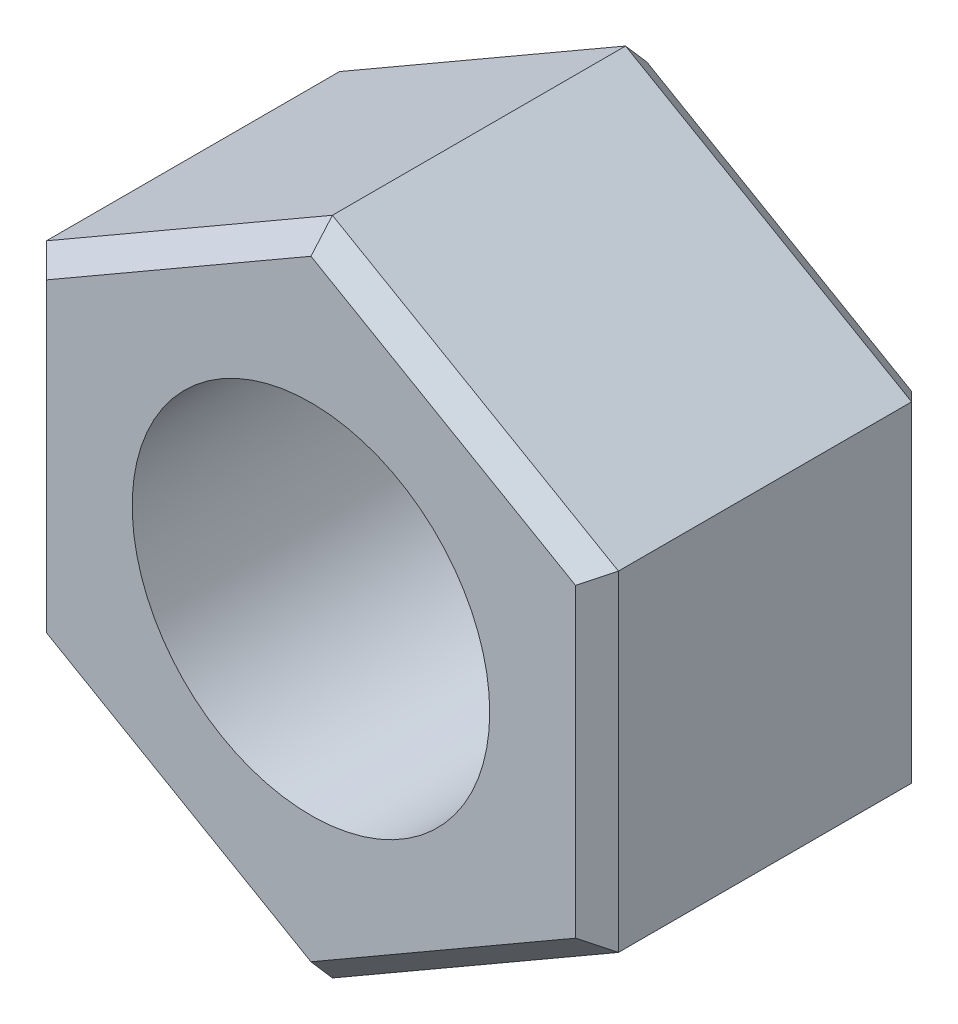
ISO-10303-21;
HEADER;
FILE_DESCRIPTION(('STEP AP214'),'2;1');
FILE_NAME('part.step','',(''),(''),'','','');
FILE_SCHEMA(('AUTOMOTIVE_DESIGN { 1 0 10303 214 1 1 1 1 }'));
ENDSEC;
DATA;
#1=APPLICATION_CONTEXT('core data for automotive mechanical design processes');
#2=APPLICATION_PROTOCOL_DEFINITION('international standard','automotive_design',2000,#1);
#3=PRODUCT_CONTEXT('',#1,'mechanical');
#4=PRODUCT('Part','Part','',(#3));
#5=PRODUCT_RELATED_PRODUCT_CATEGORY('part','',(#4));
#6=PRODUCT_DEFINITION_FORMATION('','',#4);
#7=PRODUCT_DEFINITION_CONTEXT('part definition',#1,'design');
#8=PRODUCT_DEFINITION('design','',#6,#7);
#9=PRODUCT_DEFINITION_SHAPE('','',#8);
#10=(LENGTH_UNIT() NAMED_UNIT(*) SI_UNIT(.MILLI.,.METRE.));
#11=(NAMED_UNIT(*) PLANE_ANGLE_UNIT() SI_UNIT($,.RADIAN.));
#12=(NAMED_UNIT(*) SI_UNIT($,.STERADIAN.) SOLID_ANGLE_UNIT());
#13=UNCERTAINTY_MEASURE_WITH_UNIT(LENGTH_MEASURE(1.E-05),#10,'distance_accuracy_value','');
#14=(GEOMETRIC_REPRESENTATION_CONTEXT(3) GLOBAL_UNCERTAINTY_ASSIGNED_CONTEXT((#13)) GLOBAL_UNIT_ASSIGNED_CONTEXT((#10,
#11,#12)) REPRESENTATION_CONTEXT('',''));
#15=CARTESIAN_POINT('',(0.,0.,0.));
#16=DIRECTION('',(0.,0.,1.));
#17=DIRECTION('',(1.,0.,0.));
#18=AXIS2_PLACEMENT_3D('',#15,#16,#17);
#19=CARTESIAN_POINT('',(3.99999999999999,2.3094010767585,4.7));
#20=DIRECTION('',(-0.5,-0.866025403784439,0.));
#21=DIRECTION('',(0.866025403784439,-0.5,0.));
#22=AXIS2_PLACEMENT_3D('',#19,#20,#21);
#23=PLANE('',#22);
#24=DIRECTION('',(0.,0.,-1.));
#25=VECTOR('',#24,1.);
#26=CARTESIAN_POINT('',(0.,4.618802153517,4.7));
#27=LINE('',#26,#25);
#28=CARTESIAN_POINT('',(0.,4.618802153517,4.4));
#29=VERTEX_POINT('',#28);
#30=CARTESIAN_POINT('',(0.,4.618802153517,0.300000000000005));
#31=VERTEX_POINT('',#30);
#32=EDGE_CURVE('E121',#29,#31,#27,.T.);
#33=ORIENTED_EDGE('',*,*,#32,.F.);
#34=DIRECTION('',(0.866025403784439,-0.5,0.));
#35=VECTOR('',#34,1.);
#36=CARTESIAN_POINT('',(3.99999999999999,2.3094010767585,4.4));
#37=LINE('',#36,#35);
#38=CARTESIAN_POINT('',(3.99999999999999,2.3094010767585,4.4));
#39=VERTEX_POINT('',#38);
#40=EDGE_CURVE('E195',#29,#39,#37,.T.);
#41=ORIENTED_EDGE('',*,*,#40,.T.);
#42=DIRECTION('',(0.,0.,-1.));
#43=VECTOR('',#42,1.);
#44=CARTESIAN_POINT('',(3.99999999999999,2.3094010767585,4.7));
#45=LINE('',#44,#43);
#46=CARTESIAN_POINT('',(3.99999999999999,2.3094010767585,0.300000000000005));
#47=VERTEX_POINT('',#46);
#48=EDGE_CURVE('E156',#39,#47,#45,.T.);
#49=ORIENTED_EDGE('',*,*,#48,.T.);
#50=DIRECTION('',(-0.866025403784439,0.5,0.));
#51=VECTOR('',#50,1.);
#52=CARTESIAN_POINT('',(3.99999999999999,2.3094010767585,0.300000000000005));
#53=LINE('',#52,#51);
#54=EDGE_CURVE('E132',#47,#31,#53,.T.);
#55=ORIENTED_EDGE('',*,*,#54,.T.);
#56=EDGE_LOOP('',(#33,#41,#49,#55));
#57=FACE_BOUND('',#56,.T.);
#58=ADVANCED_FACE('F33',(#57),#23,.F.);
#59=CARTESIAN_POINT('',(0.,4.618802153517,4.7));
#60=DIRECTION('',(0.5,-0.866025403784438,0.));
#61=DIRECTION('',(0.866025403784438,0.5,0.));
#62=AXIS2_PLACEMENT_3D('',#59,#60,#61);
#63=PLANE('',#62);
#64=DIRECTION('',(0.,0.,-1.));
#65=VECTOR('',#64,1.);
#66=CARTESIAN_POINT('',(-4.,2.3094010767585,4.7));
#67=LINE('',#66,#65);
#68=CARTESIAN_POINT('',(-4.,2.3094010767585,4.4));
#69=VERTEX_POINT('',#68);
#70=CARTESIAN_POINT('',(-4.,2.3094010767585,0.300000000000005));
#71=VERTEX_POINT('',#70);
#72=EDGE_CURVE('E133',#69,#71,#67,.T.);
#73=ORIENTED_EDGE('',*,*,#72,.F.);
#74=DIRECTION('',(0.866025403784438,0.5,0.));
#75=VECTOR('',#74,1.);
#76=CARTESIAN_POINT('',(0.,4.618802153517,4.4));
#77=LINE('',#76,#75);
#78=EDGE_CURVE('E129',#69,#29,#77,.T.);
#79=ORIENTED_EDGE('',*,*,#78,.T.);
#80=ORIENTED_EDGE('',*,*,#32,.T.);
#81=DIRECTION('',(-0.866025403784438,-0.5,0.));
#82=VECTOR('',#81,1.);
#83=CARTESIAN_POINT('',(0.,4.618802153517,0.300000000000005));
#84=LINE('',#83,#82);
#85=EDGE_CURVE('E126',#31,#71,#84,.T.);
#86=ORIENTED_EDGE('',*,*,#85,.T.);
#87=EDGE_LOOP('',(#73,#79,#80,#86));
#88=FACE_BOUND('',#87,.T.);
#89=ADVANCED_FACE('F124',(#88),#63,.F.);
#90=CARTESIAN_POINT('',(-4.,2.3094010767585,4.7));
#91=DIRECTION('',(1.,0.,0.));
#92=DIRECTION('',(0.,0.,-1.));
#93=AXIS2_PLACEMENT_3D('',#90,#91,#92);
#94=PLANE('',#93);
#95=DIRECTION('',(0.,0.,-1.));
#96=VECTOR('',#95,1.);
#97=CARTESIAN_POINT('',(-4.,-2.3094010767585,4.7));
#98=LINE('',#97,#96);
#99=CARTESIAN_POINT('',(-4.,-2.3094010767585,4.4));
#100=VERTEX_POINT('',#99);
#101=CARTESIAN_POINT('',(-4.,-2.3094010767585,0.300000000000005));
#102=VERTEX_POINT('',#101);
#103=EDGE_CURVE('E245',#100,#102,#98,.T.);
#104=ORIENTED_EDGE('',*,*,#103,.F.);
#105=DIRECTION('',(0.,1.,0.));
#106=VECTOR('',#105,1.);
#107=CARTESIAN_POINT('',(-4.,2.3094010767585,4.4));
#108=LINE('',#107,#106);
#109=EDGE_CURVE('E11',#100,#69,#108,.T.);
#110=ORIENTED_EDGE('',*,*,#109,.T.);
#111=ORIENTED_EDGE('',*,*,#72,.T.);
#112=DIRECTION('',(0.,-1.,0.));
#113=VECTOR('',#112,1.);
#114=CARTESIAN_POINT('',(-4.,2.3094010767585,0.300000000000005));
#115=LINE('',#114,#113);
#116=EDGE_CURVE('E153',#71,#102,#115,.T.);
#117=ORIENTED_EDGE('',*,*,#116,.T.);
#118=EDGE_LOOP('',(#104,#110,#111,#117));
#119=FACE_BOUND('',#118,.T.);
#120=ADVANCED_FACE('F247',(#119),#94,.F.);
#121=CARTESIAN_POINT('',(-4.,-2.3094010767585,4.7));
#122=DIRECTION('',(0.5,0.866025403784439,0.));
#123=DIRECTION('',(-0.866025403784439,0.5,0.));
#124=AXIS2_PLACEMENT_3D('',#121,#122,#123);
#125=PLANE('',#124);
#126=DIRECTION('',(0.,0.,-1.));
#127=VECTOR('',#126,1.);
#128=CARTESIAN_POINT('',(0.,-4.618802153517,4.7));
#129=LINE('',#128,#127);
#130=CARTESIAN_POINT('',(0.,-4.618802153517,4.4));
#131=VERTEX_POINT('',#130);
#132=CARTESIAN_POINT('',(0.,-4.618802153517,0.300000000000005));
#133=VERTEX_POINT('',#132);
#134=EDGE_CURVE('E210',#131,#133,#129,.T.);
#135=ORIENTED_EDGE('',*,*,#134,.F.);
#136=DIRECTION('',(-0.866025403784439,0.5,0.));
#137=VECTOR('',#136,1.);
#138=CARTESIAN_POINT('',(-4.,-2.3094010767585,4.4));
#139=LINE('',#138,#137);
#140=EDGE_CURVE('E40',#131,#100,#139,.T.);
#141=ORIENTED_EDGE('',*,*,#140,.T.);
#142=ORIENTED_EDGE('',*,*,#103,.T.);
#143=DIRECTION('',(0.866025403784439,-0.5,0.));
#144=VECTOR('',#143,1.);
#145=CARTESIAN_POINT('',(-4.,-2.3094010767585,0.300000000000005));
#146=LINE('',#145,#144);
#147=EDGE_CURVE('E177',#102,#133,#146,.T.);
#148=ORIENTED_EDGE('',*,*,#147,.T.);
#149=EDGE_LOOP('',(#135,#141,#142,#148));
#150=FACE_BOUND('',#149,.T.);
#151=ADVANCED_FACE('F292',(#150),#125,.F.);
#152=CARTESIAN_POINT('',(0.,-4.618802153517,4.7));
#153=DIRECTION('',(-0.5,0.866025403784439,0.));
#154=DIRECTION('',(-0.866025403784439,-0.5,0.));
#155=AXIS2_PLACEMENT_3D('',#152,#153,#154);
#156=PLANE('',#155);
#157=DIRECTION('',(0.,0.,-1.));
#158=VECTOR('',#157,1.);
#159=CARTESIAN_POINT('',(3.99999999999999,-2.3094010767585,4.7));
#160=LINE('',#159,#158);
#161=CARTESIAN_POINT('',(3.99999999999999,-2.3094010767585,4.4));
#162=VERTEX_POINT('',#161);
#163=CARTESIAN_POINT('',(3.99999999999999,-2.3094010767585,0.300000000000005));
#164=VERTEX_POINT('',#163);
#165=EDGE_CURVE('E202',#162,#164,#160,.T.);
#166=ORIENTED_EDGE('',*,*,#165,.F.);
#167=DIRECTION('',(-0.866025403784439,-0.5,0.));
#168=VECTOR('',#167,1.);
#169=CARTESIAN_POINT('',(0.,-4.618802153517,4.4));
#170=LINE('',#169,#168);
#171=EDGE_CURVE('E54',#162,#131,#170,.T.);
#172=ORIENTED_EDGE('',*,*,#171,.T.);
#173=ORIENTED_EDGE('',*,*,#134,.T.);
#174=DIRECTION('',(0.866025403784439,0.5,0.));
#175=VECTOR('',#174,1.);
#176=CARTESIAN_POINT('',(0.,-4.618802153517,0.300000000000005));
#177=LINE('',#176,#175);
#178=EDGE_CURVE('E174',#133,#164,#177,.T.);
#179=ORIENTED_EDGE('',*,*,#178,.T.);
#180=EDGE_LOOP('',(#166,#172,#173,#179));
#181=FACE_BOUND('',#180,.T.);
#182=ADVANCED_FACE('F207',(#181),#156,.F.);
#183=CARTESIAN_POINT('',(3.99999999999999,-2.3094010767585,4.7));
#184=DIRECTION('',(-1.,0.,0.));
#185=DIRECTION('',(0.,0.,1.));
#186=AXIS2_PLACEMENT_3D('',#183,#184,#185);
#187=PLANE('',#186);
#188=ORIENTED_EDGE('',*,*,#48,.F.);
#189=DIRECTION('',(0.,-1.,0.));
#190=VECTOR('',#189,1.);
#191=CARTESIAN_POINT('',(3.99999999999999,-2.3094010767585,4.4));
#192=LINE('',#191,#190);
#193=EDGE_CURVE('E197',#39,#162,#192,.T.);
#194=ORIENTED_EDGE('',*,*,#193,.T.);
#195=ORIENTED_EDGE('',*,*,#165,.T.);
#196=DIRECTION('',(0.,1.,0.));
#197=VECTOR('',#196,1.);
#198=CARTESIAN_POINT('',(3.99999999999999,-2.3094010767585,0.300000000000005));
#199=LINE('',#198,#197);
#200=EDGE_CURVE('E172',#164,#47,#199,.T.);
#201=ORIENTED_EDGE('',*,*,#200,.T.);
#202=EDGE_LOOP('',(#188,#194,#195,#201));
#203=FACE_BOUND('',#202,.T.);
#204=ADVANCED_FACE('F201',(#203),#187,.F.);
#205=CARTESIAN_POINT('',(-4.,6.92820323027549,4.7));
#206=DIRECTION('',(0.,0.,1.));
#207=DIRECTION('',(1.,0.,0.));
#208=AXIS2_PLACEMENT_3D('',#205,#206,#207);
#209=PLANE('',#208);
#210=DIRECTION('',(-0.866025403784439,0.5,0.));
#211=VECTOR('',#210,1.);
#212=CARTESIAN_POINT('',(-0.150000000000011,4.35899453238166,4.7));
#213=LINE('',#212,#211);
#214=CARTESIAN_POINT('',(3.69999999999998,2.13619599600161,4.7));
#215=VERTEX_POINT('',#214);
#216=CARTESIAN_POINT('',(0.,4.27239199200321,4.7));
#217=VERTEX_POINT('',#216);
#218=EDGE_CURVE('E189',#215,#217,#213,.T.);
#219=ORIENTED_EDGE('',*,*,#218,.T.);
#220=DIRECTION('',(-0.866025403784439,-0.5,0.));
#221=VECTOR('',#220,1.);
#222=CARTESIAN_POINT('',(-3.85,2.04959345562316,4.7));
#223=LINE('',#222,#221);
#224=CARTESIAN_POINT('',(-3.69999999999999,2.13619599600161,4.7));
#225=VERTEX_POINT('',#224);
#226=EDGE_CURVE('E191',#217,#225,#223,.T.);
#227=ORIENTED_EDGE('',*,*,#226,.T.);
#228=DIRECTION('',(0.,-1.,0.));
#229=VECTOR('',#228,1.);
#230=CARTESIAN_POINT('',(-3.69999999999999,-2.3094010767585,4.7));
#231=LINE('',#230,#229);
#232=CARTESIAN_POINT('',(-3.69999999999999,-2.13619599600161,4.7));
#233=VERTEX_POINT('',#232);
#234=EDGE_CURVE('E152',#225,#233,#231,.T.);
#235=ORIENTED_EDGE('',*,*,#234,.T.);
#236=DIRECTION('',(0.866025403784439,-0.5,0.));
#237=VECTOR('',#236,1.);
#238=CARTESIAN_POINT('',(0.149999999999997,-4.35899453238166,4.7));
#239=LINE('',#238,#237);
#240=CARTESIAN_POINT('',(0.,-4.27239199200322,4.7));
#241=VERTEX_POINT('',#240);
#242=EDGE_CURVE('E183',#233,#241,#239,.T.);
#243=ORIENTED_EDGE('',*,*,#242,.T.);
#244=DIRECTION('',(0.866025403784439,0.5,0.));
#245=VECTOR('',#244,1.);
#246=CARTESIAN_POINT('',(3.84999999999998,-2.04959345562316,4.7));
#247=LINE('',#246,#245);
#248=CARTESIAN_POINT('',(3.69999999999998,-2.13619599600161,4.7));
#249=VERTEX_POINT('',#248);
#250=EDGE_CURVE('E185',#241,#249,#247,.T.);
#251=ORIENTED_EDGE('',*,*,#250,.T.);
#252=DIRECTION('',(0.,1.,0.));
#253=VECTOR('',#252,1.);
#254=CARTESIAN_POINT('',(3.69999999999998,2.3094010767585,4.7));
#255=LINE('',#254,#253);
#256=EDGE_CURVE('E187',#249,#215,#255,.T.);
#257=ORIENTED_EDGE('',*,*,#256,.T.);
#258=EDGE_LOOP('',(#219,#227,#235,#243,#251,#257));
#259=FACE_BOUND('',#258,.T.);
#260=CARTESIAN_POINT('',(0.,0.,4.7));
#261=DIRECTION('',(0.,0.,1.));
#262=DIRECTION('',(1.,0.,0.));
#263=AXIS2_PLACEMENT_3D('',#260,#261,#262);
#264=CIRCLE('',#263,2.5);
#265=CARTESIAN_POINT('',(2.5,0.,4.7));
#266=VERTEX_POINT('',#265);
#267=EDGE_CURVE('E237',#266,#266,#264,.T.);
#268=ORIENTED_EDGE('',*,*,#267,.F.);
#269=EDGE_LOOP('',(#268));
#270=FACE_BOUND('',#269,.T.);
#271=ADVANCED_FACE('F270',(#259,#270),#209,.T.);
#272=CARTESIAN_POINT('',(-4.,6.92820323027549,0.));
#273=DIRECTION('',(0.,0.,1.));
#274=DIRECTION('',(1.,0.,0.));
#275=AXIS2_PLACEMENT_3D('',#272,#273,#274);
#276=PLANE('',#275);
#277=DIRECTION('',(0.866025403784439,0.5,0.));
#278=VECTOR('',#277,1.);
#279=CARTESIAN_POINT('',(-1.85,3.20429399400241,0.));
#280=LINE('',#279,#278);
#281=CARTESIAN_POINT('',(-3.7,2.13619599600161,0.));
#282=VERTEX_POINT('',#281);
#283=CARTESIAN_POINT('',(0.,4.27239199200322,0.));
#284=VERTEX_POINT('',#283);
#285=EDGE_CURVE('E158',#282,#284,#280,.T.);
#286=ORIENTED_EDGE('',*,*,#285,.T.);
#287=DIRECTION('',(0.866025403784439,-0.5,0.));
#288=VECTOR('',#287,1.);
#289=CARTESIAN_POINT('',(-4.15,6.66839560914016,0.));
#290=LINE('',#289,#288);
#291=CARTESIAN_POINT('',(3.69999999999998,2.13619599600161,0.));
#292=VERTEX_POINT('',#291);
#293=EDGE_CURVE('E142',#284,#292,#290,.T.);
#294=ORIENTED_EDGE('',*,*,#293,.T.);
#295=DIRECTION('',(0.,-1.,0.));
#296=VECTOR('',#295,1.);
#297=CARTESIAN_POINT('',(3.69999999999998,6.92820323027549,0.));
#298=LINE('',#297,#296);
#299=CARTESIAN_POINT('',(3.69999999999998,-2.13619599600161,0.));
#300=VERTEX_POINT('',#299);
#301=EDGE_CURVE('E169',#292,#300,#298,.T.);
#302=ORIENTED_EDGE('',*,*,#301,.T.);
#303=DIRECTION('',(-0.866025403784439,-0.5,0.));
#304=VECTOR('',#303,1.);
#305=CARTESIAN_POINT('',(1.84999999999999,-3.20429399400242,0.));
#306=LINE('',#305,#304);
#307=CARTESIAN_POINT('',(0.,-4.27239199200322,0.));
#308=VERTEX_POINT('',#307);
#309=EDGE_CURVE('E167',#300,#308,#306,.T.);
#310=ORIENTED_EDGE('',*,*,#309,.T.);
#311=DIRECTION('',(-0.866025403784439,0.5,0.));
#312=VECTOR('',#311,1.);
#313=CARTESIAN_POINT('',(-7.84999999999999,0.259807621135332,0.));
#314=LINE('',#313,#312);
#315=CARTESIAN_POINT('',(-3.7,-2.13619599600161,0.));
#316=VERTEX_POINT('',#315);
#317=EDGE_CURVE('E165',#308,#316,#314,.T.);
#318=ORIENTED_EDGE('',*,*,#317,.T.);
#319=DIRECTION('',(0.,1.,0.));
#320=VECTOR('',#319,1.);
#321=CARTESIAN_POINT('',(-3.7,6.92820323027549,0.));
#322=LINE('',#321,#320);
#323=EDGE_CURVE('E160',#316,#282,#322,.T.);
#324=ORIENTED_EDGE('',*,*,#323,.T.);
#325=EDGE_LOOP('',(#286,#294,#302,#310,#318,#324));
#326=FACE_BOUND('',#325,.T.);
#327=CARTESIAN_POINT('',(0.,0.,0.));
#328=DIRECTION('',(0.,0.,1.));
#329=DIRECTION('',(1.,0.,0.));
#330=AXIS2_PLACEMENT_3D('',#327,#328,#329);
#331=CIRCLE('',#330,2.5);
#332=CARTESIAN_POINT('',(2.5,0.,0.));
#333=VERTEX_POINT('',#332);
#334=EDGE_CURVE('E240',#333,#333,#331,.T.);
#335=ORIENTED_EDGE('',*,*,#334,.T.);
#336=EDGE_LOOP('',(#335));
#337=FACE_BOUND('',#336,.T.);
#338=ADVANCED_FACE('F302',(#326,#337),#276,.F.);
#339=CARTESIAN_POINT('',(0.,0.,0.));
#340=DIRECTION('',(0.,0.,1.));
#341=DIRECTION('',(1.,0.,0.));
#342=AXIS2_PLACEMENT_3D('',#339,#340,#341);
#343=CYLINDRICAL_SURFACE('',#342,2.5);
#344=ORIENTED_EDGE('',*,*,#334,.F.);
#345=EDGE_LOOP('',(#344));
#346=FACE_BOUND('',#345,.T.);
#347=ORIENTED_EDGE('',*,*,#267,.T.);
#348=EDGE_LOOP('',(#347));
#349=FACE_BOUND('',#348,.T.);
#350=ADVANCED_FACE('F305',(#346,#349),#343,.F.);
#351=CARTESIAN_POINT('',(-4.,-2.3094010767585,0.300000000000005));
#352=DIRECTION('',(0.353553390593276,0.612372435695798,0.707106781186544));
#353=DIRECTION('',(0.,-0.755928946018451,0.654653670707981));
#354=AXIS2_PLACEMENT_3D('',#351,#352,#353);
#355=PLANE('',#354);
#356=DIRECTION('',(-0.654653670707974,-0.377964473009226,0.654653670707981));
#357=VECTOR('',#356,1.);
#358=CARTESIAN_POINT('',(-2.85714285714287,-1.64957219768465,-0.842857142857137));
#359=LINE('',#358,#357);
#360=EDGE_CURVE('E231',#316,#102,#359,.T.);
#361=ORIENTED_EDGE('',*,*,#360,.F.);
#362=ORIENTED_EDGE('',*,*,#317,.F.);
#363=DIRECTION('',(0.,-0.755928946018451,0.654653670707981));
#364=VECTOR('',#363,1.);
#365=CARTESIAN_POINT('',(0.,-3.2991443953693,-0.842857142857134));
#366=LINE('',#365,#364);
#367=EDGE_CURVE('E234',#133,#308,#366,.F.);
#368=ORIENTED_EDGE('',*,*,#367,.F.);
#369=ORIENTED_EDGE('',*,*,#147,.F.);
#370=EDGE_LOOP('',(#361,#362,#368,#369));
#371=FACE_BOUND('',#370,.T.);
#372=ADVANCED_FACE('F309',(#371),#355,.F.);
#373=CARTESIAN_POINT('',(0.,-4.618802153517,0.300000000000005));
#374=DIRECTION('',(-0.353553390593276,0.612372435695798,0.707106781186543));
#375=DIRECTION('',(0.,-0.75592894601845,0.654653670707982));
#376=AXIS2_PLACEMENT_3D('',#373,#374,#375);
#377=PLANE('',#376);
#378=ORIENTED_EDGE('',*,*,#367,.T.);
#379=ORIENTED_EDGE('',*,*,#309,.F.);
#380=DIRECTION('',(0.654653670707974,-0.377964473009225,0.654653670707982));
#381=VECTOR('',#380,1.);
#382=CARTESIAN_POINT('',(2.85714285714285,-1.64957219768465,-0.84285714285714));
#383=LINE('',#382,#381);
#384=EDGE_CURVE('E228',#164,#300,#383,.F.);
#385=ORIENTED_EDGE('',*,*,#384,.F.);
#386=ORIENTED_EDGE('',*,*,#178,.F.);
#387=EDGE_LOOP('',(#378,#379,#385,#386));
#388=FACE_BOUND('',#387,.T.);
#389=ADVANCED_FACE('F313',(#388),#377,.F.);
#390=CARTESIAN_POINT('',(-4.,2.3094010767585,0.300000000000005));
#391=DIRECTION('',(0.707106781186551,0.,0.707106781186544));
#392=DIRECTION('',(0.707106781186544,0.,-0.707106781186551));
#393=AXIS2_PLACEMENT_3D('',#390,#391,#392);
#394=PLANE('',#393);
#395=ORIENTED_EDGE('',*,*,#360,.T.);
#396=ORIENTED_EDGE('',*,*,#116,.F.);
#397=DIRECTION('',(-0.654653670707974,0.377964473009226,0.654653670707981));
#398=VECTOR('',#397,1.);
#399=CARTESIAN_POINT('',(-2.85714285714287,1.64957219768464,-0.842857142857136));
#400=LINE('',#399,#398);
#401=EDGE_CURVE('E151',#282,#71,#400,.T.);
#402=ORIENTED_EDGE('',*,*,#401,.F.);
#403=ORIENTED_EDGE('',*,*,#323,.F.);
#404=EDGE_LOOP('',(#395,#396,#402,#403));
#405=FACE_BOUND('',#404,.T.);
#406=ADVANCED_FACE('F317',(#405),#394,.F.);
#407=CARTESIAN_POINT('',(3.99999999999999,-2.3094010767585,0.300000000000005));
#408=DIRECTION('',(-0.707106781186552,0.,0.707106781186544));
#409=DIRECTION('',(0.707106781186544,0.,0.707106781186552));
#410=AXIS2_PLACEMENT_3D('',#407,#408,#409);
#411=PLANE('',#410);
#412=ORIENTED_EDGE('',*,*,#384,.T.);
#413=ORIENTED_EDGE('',*,*,#301,.F.);
#414=DIRECTION('',(0.654653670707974,0.377964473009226,0.654653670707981));
#415=VECTOR('',#414,1.);
#416=CARTESIAN_POINT('',(2.85714285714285,1.64957219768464,-0.84285714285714));
#417=LINE('',#416,#415);
#418=EDGE_CURVE('E145',#47,#292,#417,.F.);
#419=ORIENTED_EDGE('',*,*,#418,.F.);
#420=ORIENTED_EDGE('',*,*,#200,.F.);
#421=EDGE_LOOP('',(#412,#413,#419,#420));
#422=FACE_BOUND('',#421,.T.);
#423=ADVANCED_FACE('F321',(#422),#411,.F.);
#424=CARTESIAN_POINT('',(0.,4.618802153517,0.300000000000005));
#425=DIRECTION('',(0.353553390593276,-0.612372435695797,0.707106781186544));
#426=DIRECTION('',(0.,-0.755928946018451,-0.654653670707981));
#427=AXIS2_PLACEMENT_3D('',#424,#425,#426);
#428=PLANE('',#427);
#429=ORIENTED_EDGE('',*,*,#401,.T.);
#430=ORIENTED_EDGE('',*,*,#85,.F.);
#431=DIRECTION('',(0.,-0.755928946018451,-0.654653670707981));
#432=VECTOR('',#431,1.);
#433=CARTESIAN_POINT('',(0.,4.618802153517,0.300000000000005));
#434=LINE('',#433,#432);
#435=EDGE_CURVE('E139',#284,#31,#434,.F.);
#436=ORIENTED_EDGE('',*,*,#435,.F.);
#437=ORIENTED_EDGE('',*,*,#285,.F.);
#438=EDGE_LOOP('',(#429,#430,#436,#437));
#439=FACE_BOUND('',#438,.T.);
#440=ADVANCED_FACE('F149',(#439),#428,.F.);
#441=CARTESIAN_POINT('',(3.99999999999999,2.3094010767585,0.300000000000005));
#442=DIRECTION('',(-0.353553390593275,-0.612372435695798,0.707106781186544));
#443=DIRECTION('',(0.,-0.755928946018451,-0.654653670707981));
#444=AXIS2_PLACEMENT_3D('',#441,#442,#443);
#445=PLANE('',#444);
#446=ORIENTED_EDGE('',*,*,#418,.T.);
#447=ORIENTED_EDGE('',*,*,#293,.F.);
#448=ORIENTED_EDGE('',*,*,#435,.T.);
#449=ORIENTED_EDGE('',*,*,#54,.F.);
#450=EDGE_LOOP('',(#446,#447,#448,#449));
#451=FACE_BOUND('',#450,.T.);
#452=ADVANCED_FACE('F140',(#451),#445,.F.);
#453=CARTESIAN_POINT('',(1.84999999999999,-3.20429399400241,4.7));
#454=DIRECTION('',(0.353553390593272,-0.612372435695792,0.707106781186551));
#455=DIRECTION('',(0.,-0.755928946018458,-0.654653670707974));
#456=AXIS2_PLACEMENT_3D('',#453,#454,#455);
#457=PLANE('',#456);
#458=DIRECTION('',(0.,0.755928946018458,0.654653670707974));
#459=VECTOR('',#458,1.);
#460=CARTESIAN_POINT('',(0.,-1.68256364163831,6.94285714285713));
#461=LINE('',#460,#459);
#462=EDGE_CURVE('E219',#131,#241,#461,.T.);
#463=ORIENTED_EDGE('',*,*,#462,.F.);
#464=ORIENTED_EDGE('',*,*,#171,.F.);
#465=DIRECTION('',(-0.654653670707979,0.377964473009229,0.654653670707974));
#466=VECTOR('',#465,1.);
#467=CARTESIAN_POINT('',(3.17142857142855,-1.83102513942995,5.22857142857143));
#468=LINE('',#467,#466);
#469=EDGE_CURVE('E146',#249,#162,#468,.F.);
#470=ORIENTED_EDGE('',*,*,#469,.F.);
#471=ORIENTED_EDGE('',*,*,#250,.F.);
#472=EDGE_LOOP('',(#463,#464,#470,#471));
#473=FACE_BOUND('',#472,.T.);
#474=ADVANCED_FACE('F215',(#473),#457,.T.);
#475=CARTESIAN_POINT('',(3.69999999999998,6.92820323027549,4.7));
#476=DIRECTION('',(0.707106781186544,0.,0.707106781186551));
#477=DIRECTION('',(0.707106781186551,0.,-0.707106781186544));
#478=AXIS2_PLACEMENT_3D('',#475,#476,#477);
#479=PLANE('',#478);
#480=ORIENTED_EDGE('',*,*,#469,.T.);
#481=ORIENTED_EDGE('',*,*,#193,.F.);
#482=DIRECTION('',(-0.65465367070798,-0.377964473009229,0.654653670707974));
#483=VECTOR('',#482,1.);
#484=CARTESIAN_POINT('',(4.88571428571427,2.82076845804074,3.51428571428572));
#485=LINE('',#484,#483);
#486=EDGE_CURVE('E222',#215,#39,#485,.F.);
#487=ORIENTED_EDGE('',*,*,#486,.F.);
#488=ORIENTED_EDGE('',*,*,#256,.F.);
#489=EDGE_LOOP('',(#480,#481,#487,#488));
#490=FACE_BOUND('',#489,.T.);
#491=ADVANCED_FACE('F220',(#490),#479,.T.);
#492=CARTESIAN_POINT('',(-7.84999999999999,0.259807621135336,4.7));
#493=DIRECTION('',(-0.353553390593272,-0.612372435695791,0.707106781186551));
#494=DIRECTION('',(0.,-0.755928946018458,-0.654653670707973));
#495=AXIS2_PLACEMENT_3D('',#492,#493,#494);
#496=PLANE('',#495);
#497=ORIENTED_EDGE('',*,*,#462,.T.);
#498=ORIENTED_EDGE('',*,*,#242,.F.);
#499=DIRECTION('',(0.654653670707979,0.37796447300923,0.654653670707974));
#500=VECTOR('',#499,1.);
#501=CARTESIAN_POINT('',(-1.45714285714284,-0.841281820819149,6.94285714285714));
#502=LINE('',#501,#500);
#503=EDGE_CURVE('E263',#100,#233,#502,.T.);
#504=ORIENTED_EDGE('',*,*,#503,.F.);
#505=ORIENTED_EDGE('',*,*,#140,.F.);
#506=EDGE_LOOP('',(#497,#498,#504,#505));
#507=FACE_BOUND('',#506,.T.);
#508=ADVANCED_FACE('F274',(#507),#496,.T.);
#509=CARTESIAN_POINT('',(-4.15,6.66839560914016,4.7));
#510=DIRECTION('',(0.353553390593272,0.612372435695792,0.707106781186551));
#511=DIRECTION('',(0.,-0.755928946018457,0.654653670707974));
#512=AXIS2_PLACEMENT_3D('',#509,#510,#511);
#513=PLANE('',#512);
#514=ORIENTED_EDGE('',*,*,#486,.T.);
#515=ORIENTED_EDGE('',*,*,#40,.F.);
#516=DIRECTION('',(0.,-0.755928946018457,0.654653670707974));
#517=VECTOR('',#516,1.);
#518=CARTESIAN_POINT('',(0.,5.64153691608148,3.51428571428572));
#519=LINE('',#518,#517);
#520=EDGE_CURVE('E257',#217,#29,#519,.F.);
#521=ORIENTED_EDGE('',*,*,#520,.F.);
#522=ORIENTED_EDGE('',*,*,#218,.F.);
#523=EDGE_LOOP('',(#514,#515,#521,#522));
#524=FACE_BOUND('',#523,.T.);
#525=ADVANCED_FACE('F268',(#524),#513,.T.);
#526=CARTESIAN_POINT('',(-3.69999999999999,6.92820323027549,4.7));
#527=DIRECTION('',(-0.707106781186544,0.,0.707106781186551));
#528=DIRECTION('',(0.707106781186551,0.,0.707106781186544));
#529=AXIS2_PLACEMENT_3D('',#526,#527,#528);
#530=PLANE('',#529);
#531=ORIENTED_EDGE('',*,*,#503,.T.);
#532=ORIENTED_EDGE('',*,*,#234,.F.);
#533=DIRECTION('',(-0.65465367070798,0.377964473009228,-0.654653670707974));
#534=VECTOR('',#533,1.);
#535=CARTESIAN_POINT('',(-4.88571428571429,2.82076845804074,3.51428571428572));
#536=LINE('',#535,#534);
#537=EDGE_CURVE('E254',#69,#225,#536,.F.);
#538=ORIENTED_EDGE('',*,*,#537,.F.);
#539=ORIENTED_EDGE('',*,*,#109,.F.);
#540=EDGE_LOOP('',(#531,#532,#538,#539));
#541=FACE_BOUND('',#540,.T.);
#542=ADVANCED_FACE('F261',(#541),#530,.T.);
#543=CARTESIAN_POINT('',(-1.85,3.20429399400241,4.7));
#544=DIRECTION('',(-0.353553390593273,0.612372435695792,0.707106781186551));
#545=DIRECTION('',(0.,-0.755928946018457,0.654653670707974));
#546=AXIS2_PLACEMENT_3D('',#543,#544,#545);
#547=PLANE('',#546);
#548=ORIENTED_EDGE('',*,*,#520,.T.);
#549=ORIENTED_EDGE('',*,*,#78,.F.);
#550=ORIENTED_EDGE('',*,*,#537,.T.);
#551=ORIENTED_EDGE('',*,*,#226,.F.);
#552=EDGE_LOOP('',(#548,#549,#550,#551));
#553=FACE_BOUND('',#552,.T.);
#554=ADVANCED_FACE('F252',(#553),#547,.T.);
#555=CLOSED_SHELL('',(#58,#89,#120,#151,#182,#204,#271,#338,#350,#372,#389,#406,#423,#440,#452,
#474,#491,#508,#525,#542,#554));
#556=MANIFOLD_SOLID_BREP('B2',#555);
#557=ADVANCED_BREP_SHAPE_REPRESENTATION('',(#18,#556),#14);
#558=SHAPE_DEFINITION_REPRESENTATION(#9,#557);
ENDSEC;
END-ISO-10303-21;
